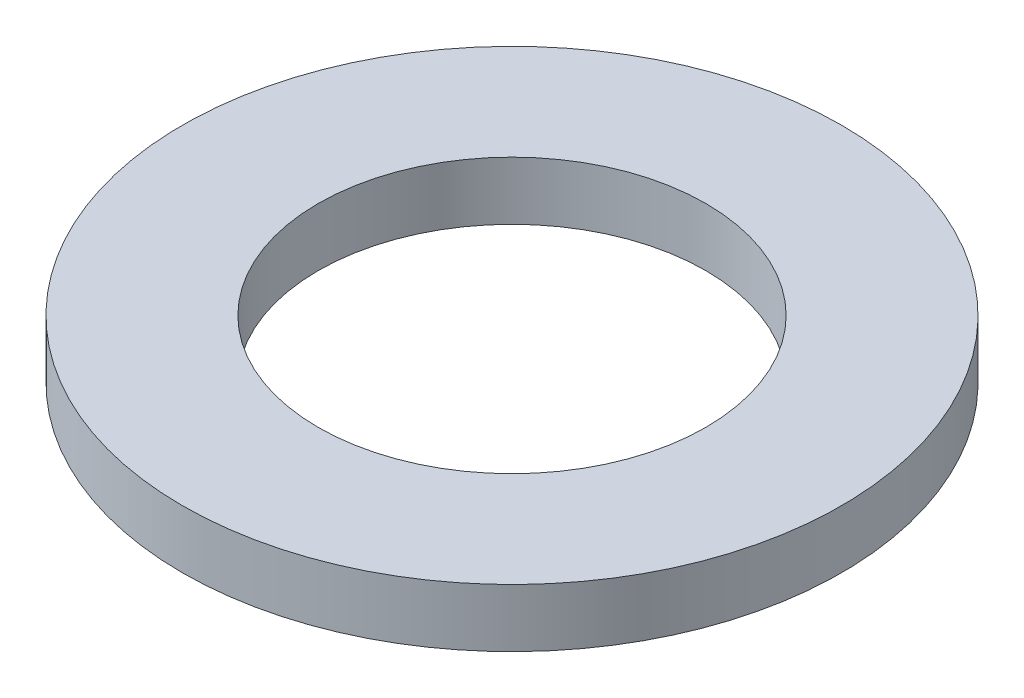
from build123d import *

# Parameters (mm, degrees)
SKETCH1_R      = 42.5
SKETCH1_R_2    = 25
EXTRUDE1_DEPTH = 7.5


with BuildPart() as part:
    # Sketch1 → Extrude1 (new body)
    with BuildSketch(Plane(origin=(0, 0, 0), x_dir=(1, 0, 0), z_dir=(0, 1, 0))):
        with Locations(Location((0, 0, 0), (0, 0, 270))):
            Circle(SKETCH1_R)
        with Locations(Location((0, 0, 0), (0, 0, 270))):
            Circle(SKETCH1_R_2, mode=Mode.SUBTRACT)
    extrude(amount=EXTRUDE1_DEPTH)


solid = part.part
